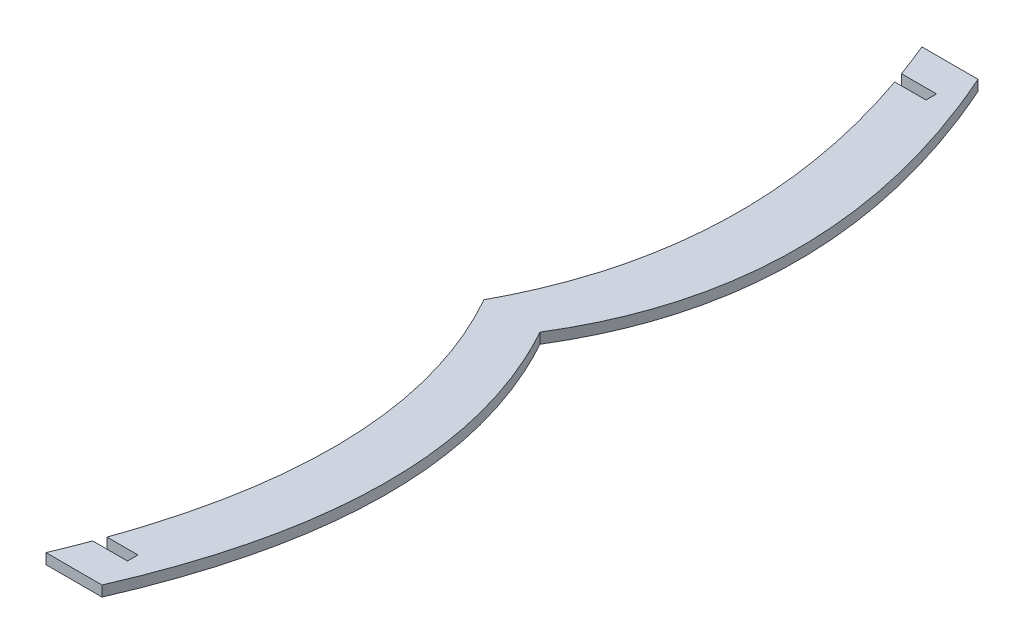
from build123d import *

# Parameters (mm, degrees)
BOSS_EXTRUDE1_DEPTH = 3
SKETCH2_W           = 10
SKETCH2_H           = 3
CUT_EXTRUDE1_DEPTH  = 39.71


with BuildPart() as part:
    # Sketch1 → Boss-Extrude1 (new body)
    with BuildSketch(Plane(origin=(0, 0, 0), x_dir=(1, 0, 0), z_dir=(0, 1, 0))):
        with BuildLine():
            Line((0, 132.962431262), (16, 132.962431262))
            add(Edge.make_bspline(
                [(16, 132.962431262), (48.2300407, 60.31873963), (16, 7.962431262)],
                knots=[0, 0, 0, 0.900398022, 0.900398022, 0.900398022], degree=2))
            add(Edge.make_bspline(
                [(16, -117.037568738), (46.347291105, -47.146473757), (16, 7.962431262)],
                knots=[0, 0, 0, 0.67932989, 0.67932989, 0.67932989], degree=2))
            Line((16, -117.037568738), (0, -117.037568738))
            add(Edge.make_bspline(
                [(0, -117.037568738), (30.089730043, -45.521323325), (0, 7.962431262)],
                knots=[0, 0, 0, 0.875472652, 0.875472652, 0.875472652], degree=2))
            add(Edge.make_bspline(
                [(0, 132.962431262), (29.311006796, 62.106602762), (0, 7.962431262)],
                knots=[0, 0, 0, 0.889395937, 0.889395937, 0.889395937], degree=2))
        make_face()
    extrude(amount=BOSS_EXTRUDE1_DEPTH)

    # Sketch2 → Cut-Extrude1 (cut)
    with BuildSketch(Plane(origin=(0, 3, 0), x_dir=(1, 0, 0), z_dir=(0, 1, 0))):
        with Locations((8.710953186, 121.915082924)):
            Rectangle(SKETCH2_W, SKETCH2_H)
        with Locations((8.710953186, -105.990220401)):
            Rectangle(SKETCH2_W, SKETCH2_H)
    extrude(amount=-CUT_EXTRUDE1_DEPTH, mode=Mode.SUBTRACT)


solid = part.part
